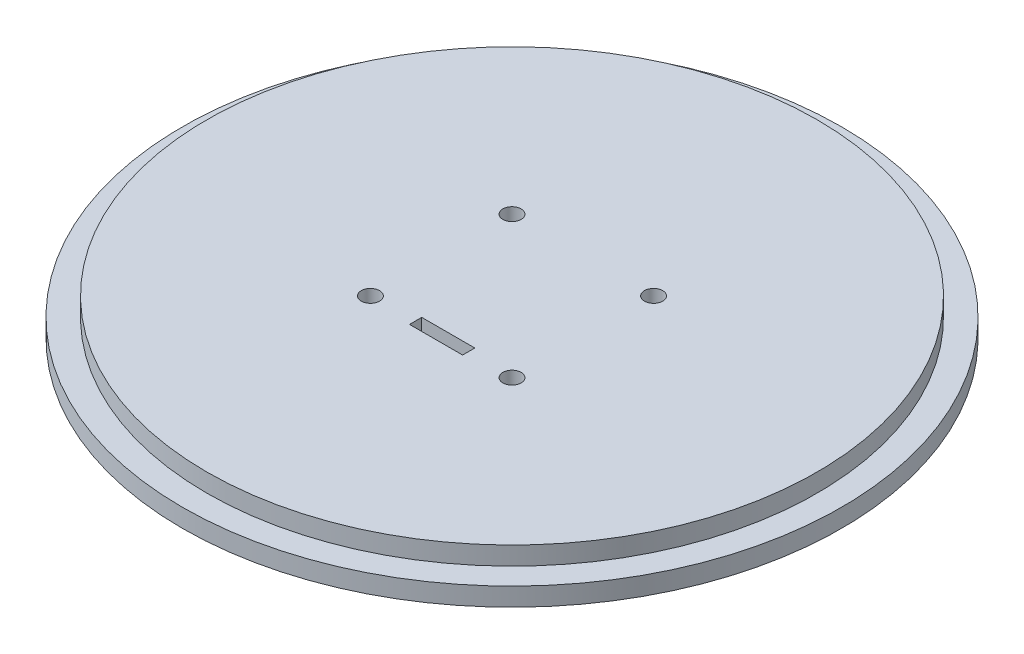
from build123d import *

# Parameters (mm, degrees)
SKETCH2_R           = 54
BOSS_EXTRUDE1_DEPTH = 3
SKETCH3_R           = 50
BOSS_EXTRUDE3_DEPTH = 3
SKETCH4_R           = 1.5
SKETCH4_W           = 8.7
SKETCH4_H           = 2
CUT_EXTRUDE6_DEPTH  = 6
SKETCH4_8_W         = 28.3
SKETCH4_8_H         = 28.3
SKETCH4_8_R         = 1.5
SKETCH4_8_W_2       = 8.7
SKETCH4_8_H_2       = 2
CUT_EXTRUDE7_DEPTH  = 3


with BuildPart() as part:
    # Sketch2 → Boss-Extrude1 (new body)
    with BuildSketch(Plane(origin=(0, 0, 0), x_dir=(1, 0, 0), z_dir=(0, 1, 0))):
        with Locations(Location((0, 0, 0), (0, 0, 270))):
            Circle(SKETCH2_R)
    extrude(amount=BOSS_EXTRUDE1_DEPTH)

    # Sketch3 → Boss-Extrude3 (add)
    with BuildSketch(Plane(origin=(0, 3, 0), x_dir=(1, 0, 0), z_dir=(0, 1, 0))):
        with Locations(Location((0, 0, 0), (0, 0, 270))):
            Circle(SKETCH3_R)
    extrude(amount=BOSS_EXTRUDE3_DEPTH)

    # Sketch4 → Cut-Extrude6 (cut)
    with BuildSketch(Plane(origin=(0, 0, 0), x_dir=(-1, 0, 0), z_dir=(0, -1, 0))):
        with Locations(Location((11.6, -11.6, 0), (0, 0, 90))):
            Circle(SKETCH4_R)
        with Locations(Location((-11.6, -11.6, 0), (0, 0, 90))):
            Circle(SKETCH4_R)
        with Locations(Location((11.6, 11.6, 0), (0, 0, 90))):
            Circle(SKETCH4_R)
        with Locations(Location((-11.6, 11.6, 0), (0, 0, 90))):
            Circle(SKETCH4_R)
        with Locations((0, -11.441615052)):
            Rectangle(SKETCH4_W, SKETCH4_H)
    extrude(amount=-CUT_EXTRUDE6_DEPTH, mode=Mode.SUBTRACT)

    # Sketch4_8 → Cut-Extrude7 (cut)
    with BuildSketch(Plane(origin=(0, 0, 0), x_dir=(-1, 0, 0), z_dir=(0, -1, 0))):
        Rectangle(SKETCH4_8_W, SKETCH4_8_H)
        with Locations(Location((11.6, -11.6, 0), (0, 0, 90))):
            Circle(SKETCH4_8_R, mode=Mode.SUBTRACT)
        with Locations(Location((-11.6, -11.6, 0), (0, 0, 90))):
            Circle(SKETCH4_8_R, mode=Mode.SUBTRACT)
        with Locations(Location((11.6, 11.6, 0), (0, 0, 90))):
            Circle(SKETCH4_8_R, mode=Mode.SUBTRACT)
        with Locations(Location((-11.6, 11.6, 0), (0, 0, 90))):
            Circle(SKETCH4_8_R, mode=Mode.SUBTRACT)
        with Locations((0, -11.441615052)):
            Rectangle(SKETCH4_8_W_2, SKETCH4_8_H_2, mode=Mode.SUBTRACT)
    extrude(amount=-CUT_EXTRUDE7_DEPTH, mode=Mode.SUBTRACT)


solid = part.part
